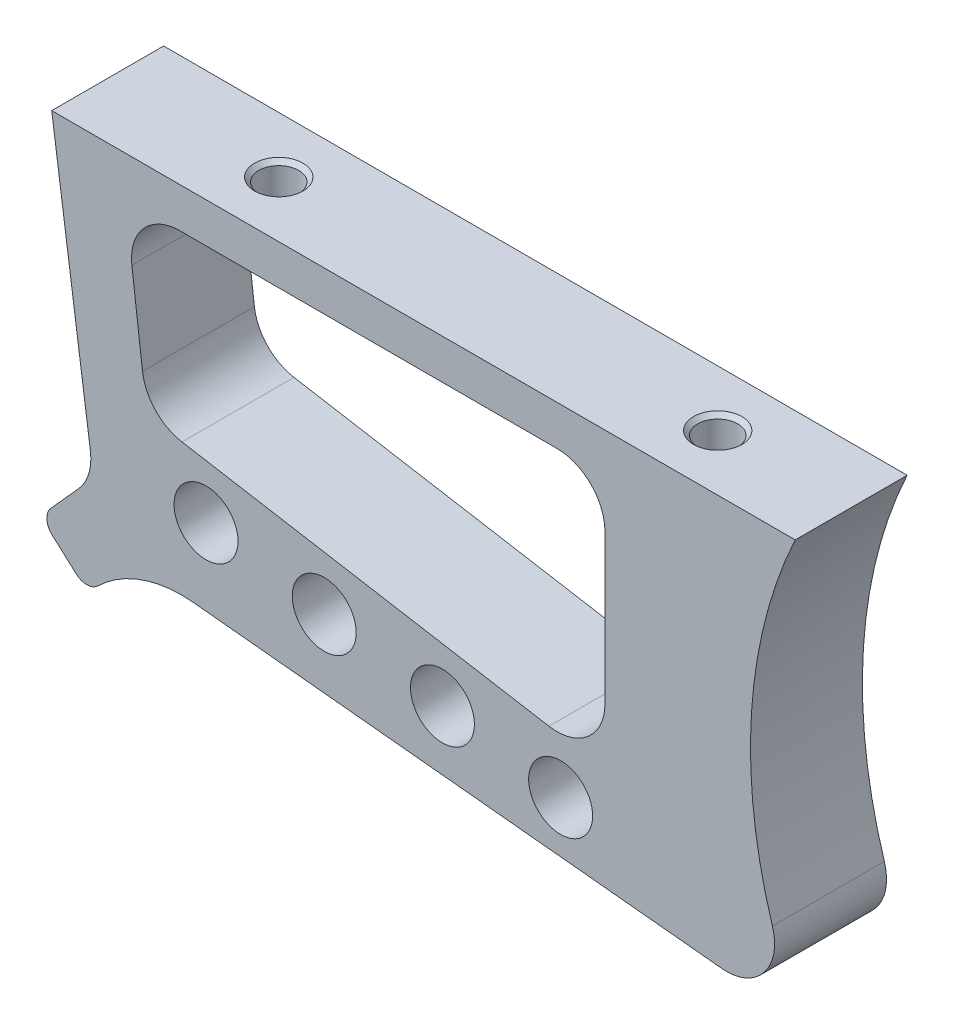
from build123d import *

# Parameters (mm, degrees)
SKETCH_1_R                   = 4
EXTRUDE_1_DEPTH              = 7
HOLE_WIZARD_M6_1_D           = 5
HOLE_WIZARD_M6_1_DEPTH       = 12
HOLE_WIZARD_M6_1_CSINK_D     = 6.05
HOLE_WIZARD_M6_1_CSINK_ANGLE = 90
HOLE_WIZARD_M6_1_TIP         = 1.502151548
SKETCH_5_R                   = 6
CUT_EXTRUDE_3_DEPTH          = 14
HOLE_WIZARD_M6_2_D           = 5
HOLE_WIZARD_M6_2_DEPTH       = 15
HOLE_WIZARD_M6_2_CSINK_D     = 6.05
HOLE_WIZARD_M6_2_CSINK_ANGLE = 90
HOLE_WIZARD_M6_2_TIP         = 1.502151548


with BuildPart() as part:
    # Sketch 1 → Extrude 1 (new, symmetric)
    with BuildSketch(Plane.XY):
        with BuildLine():
            Line((0, 0), (93, 0))
            ThreePointArc((93, 0), (87.530224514, -21.359920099), (90.145606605, -43.253398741))
            ThreePointArc((90.145606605, -43.253398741), (89.073144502, -48.835765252), (83.824248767, -51.017985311))
            Line((83.824248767, -51.017985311), (17.726749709, -44.420577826))
            ThreePointArc((17.726749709, -44.420577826), (11.259609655, -45.196285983), (5.730989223, -48.640118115))
            Line((5.730989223, -48.640118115), (5.728657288, -48.640118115))
            ThreePointArc((5.728657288, -48.640118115), (4.390396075, -49.153828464), (3.052134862, -48.640118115))
            Line((3.052134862, -48.640118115), (0.051418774, -45.938261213))
            ThreePointArc((0.051418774, -45.938261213), (-0.607579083, -44.556643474), (-0.096609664, -43.113710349))
            Line((-0.096609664, -43.113710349), (3.355994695, -39.279204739))
            ThreePointArc((3.355994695, -39.279204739), (4.634954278, -37.01865133), (4.838734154, -34.429382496))
            Line((4.838734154, -34.429382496), (0, 0))
        make_face()
        with Locations((19.3, -35)):
            Circle(SKETCH_1_R, mode=Mode.SUBTRACT)
        with Locations((34.085552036, -37.527340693)):
            Circle(SKETCH_1_R, mode=Mode.SUBTRACT)
        with Locations((48.871104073, -40.054681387)):
            Circle(SKETCH_1_R, mode=Mode.SUBTRACT)
        with Locations((63.656656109, -42.58202208)):
            Circle(SKETCH_1_R, mode=Mode.SUBTRACT)
        with BuildLine():
            Line((10.026489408, -11.73121606), (11.355960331, -22.55888782))
            ThreePointArc((11.355960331, -22.55888782), (12.969818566, -25.969179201), (16.300300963, -27.741892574))
            Line((16.300300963, -27.741892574), (62.189063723, -35.58580244))
            ThreePointArc((62.189063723, -35.58580244), (67.068745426, -34.25773566), (69.2, -29.671581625))
            Line((69.2, -29.671581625), (69.2, -11))
            ThreePointArc((69.2, -11), (67.442640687, -6.757359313), (63.2, -5))
            Line((63.2, -5), (15.981766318, -5))
            ThreePointArc((15.981766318, -5), (11.488031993, -7.024279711), (10.026489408, -11.73121606))
        make_face(mode=Mode.SUBTRACT)
    extrude(amount=EXTRUDE_1_DEPTH, both=True)

    # Hole Wizard M6 _1
    with Locations(Plane(origin=(0, 0, 0), x_dir=(1, 0, 0), z_dir=(0, 1, 0))):
        with Locations((21.4, 0), (76.303390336, 0)):
            CounterSinkHole(HOLE_WIZARD_M6_1_D / 2, HOLE_WIZARD_M6_1_CSINK_D / 2, depth=HOLE_WIZARD_M6_1_DEPTH, counter_sink_angle=HOLE_WIZARD_M6_1_CSINK_ANGLE)
            with Locations((0, 0, -(HOLE_WIZARD_M6_1_DEPTH + HOLE_WIZARD_M6_1_TIP / 2))):  # 118° drill point
                Cone(0, HOLE_WIZARD_M6_1_D / 2, HOLE_WIZARD_M6_1_TIP, mode=Mode.SUBTRACT)

    # Sketch 5 → Cut-Extrude 3 (cut)
    with BuildSketch(Plane(origin=(0, -47.5, 0), x_dir=(1, 0, 0), z_dir=(0, 1, 0))):
        with Locations(Location((74.4, 0, 0), (0, 0, 270))):
            Circle(SKETCH_5_R)
    extrude(amount=-CUT_EXTRUDE_3_DEPTH, mode=Mode.SUBTRACT)

    # Hole Wizard M6 _2
    with Locations(Plane(origin=(0, -47.5, 0), x_dir=(-1, 0, 0), z_dir=(0, -1, 0))):
        with Locations((-74.394235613, 0)):
            CounterSinkHole(HOLE_WIZARD_M6_2_D / 2, HOLE_WIZARD_M6_2_CSINK_D / 2, depth=HOLE_WIZARD_M6_2_DEPTH, counter_sink_angle=HOLE_WIZARD_M6_2_CSINK_ANGLE)
            with Locations((0, 0, -(HOLE_WIZARD_M6_2_DEPTH + HOLE_WIZARD_M6_2_TIP / 2))):  # 118° drill point
                Cone(0, HOLE_WIZARD_M6_2_D / 2, HOLE_WIZARD_M6_2_TIP, mode=Mode.SUBTRACT)


solid = part.part
